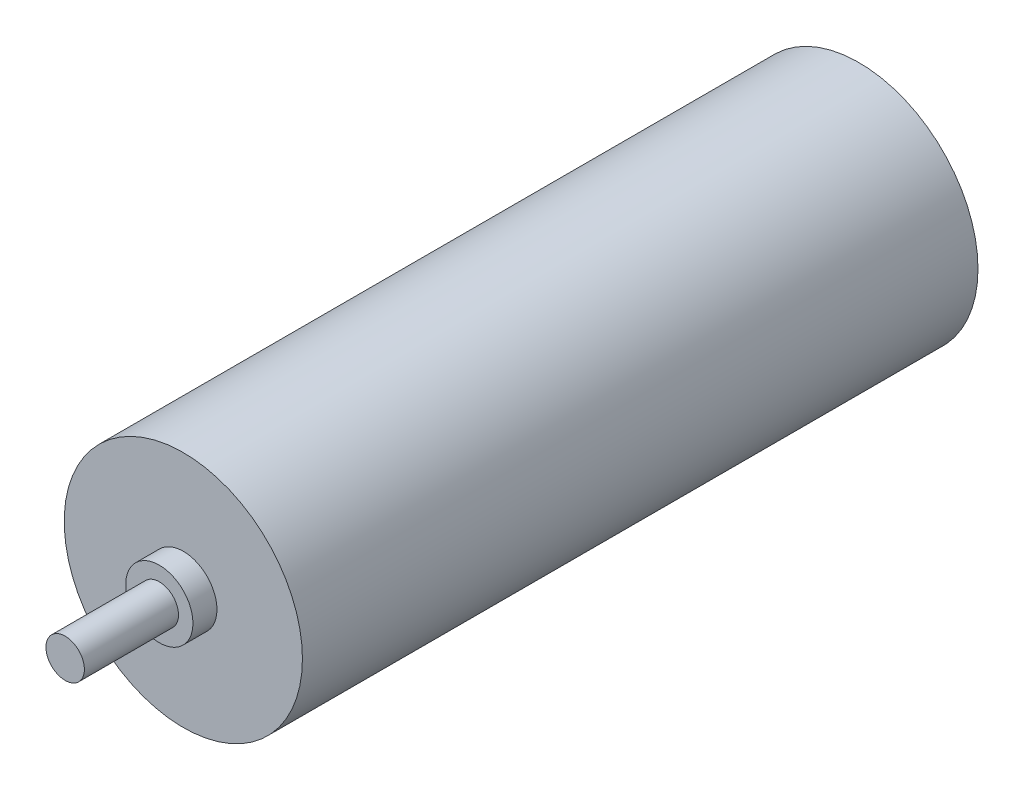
ISO-10303-21;
HEADER;
FILE_DESCRIPTION(('STEP AP214'),'2;1');
FILE_NAME('part.step','',(''),(''),'','','');
FILE_SCHEMA(('AUTOMOTIVE_DESIGN { 1 0 10303 214 1 1 1 1 }'));
ENDSEC;
DATA;
#1=APPLICATION_CONTEXT('core data for automotive mechanical design processes');
#2=APPLICATION_PROTOCOL_DEFINITION('international standard','automotive_design',2000,#1);
#3=PRODUCT_CONTEXT('',#1,'mechanical');
#4=PRODUCT('Part','Part','',(#3));
#5=PRODUCT_RELATED_PRODUCT_CATEGORY('part','',(#4));
#6=PRODUCT_DEFINITION_FORMATION('','',#4);
#7=PRODUCT_DEFINITION_CONTEXT('part definition',#1,'design');
#8=PRODUCT_DEFINITION('design','',#6,#7);
#9=PRODUCT_DEFINITION_SHAPE('','',#8);
#10=(LENGTH_UNIT() NAMED_UNIT(*) SI_UNIT(.MILLI.,.METRE.));
#11=(NAMED_UNIT(*) PLANE_ANGLE_UNIT() SI_UNIT($,.RADIAN.));
#12=(NAMED_UNIT(*) SI_UNIT($,.STERADIAN.) SOLID_ANGLE_UNIT());
#13=UNCERTAINTY_MEASURE_WITH_UNIT(LENGTH_MEASURE(1.E-05),#10,'distance_accuracy_value','');
#14=(GEOMETRIC_REPRESENTATION_CONTEXT(3) GLOBAL_UNCERTAINTY_ASSIGNED_CONTEXT((#13)) GLOBAL_UNIT_ASSIGNED_CONTEXT((#10,
#11,#12)) REPRESENTATION_CONTEXT('',''));
#15=CARTESIAN_POINT('',(0.,0.,0.));
#16=DIRECTION('',(0.,0.,1.));
#17=DIRECTION('',(1.,0.,0.));
#18=AXIS2_PLACEMENT_3D('',#15,#16,#17);
#19=CARTESIAN_POINT('',(0.,0.,72.83));
#20=DIRECTION('',(0.,0.,1.));
#21=DIRECTION('',(1.,0.,0.));
#22=AXIS2_PLACEMENT_3D('',#19,#20,#21);
#23=PLANE('',#22);
#24=CARTESIAN_POINT('',(0.,0.,72.83));
#25=DIRECTION('',(0.,0.,1.));
#26=DIRECTION('',(1.,0.,0.));
#27=AXIS2_PLACEMENT_3D('',#24,#25,#26);
#28=CIRCLE('',#27,3.5);
#29=CARTESIAN_POINT('',(3.5,0.,72.83));
#30=VERTEX_POINT('',#29);
#31=EDGE_CURVE('E39',#30,#30,#28,.T.);
#32=ORIENTED_EDGE('',*,*,#31,.T.);
#33=EDGE_LOOP('',(#32));
#34=FACE_BOUND('',#33,.T.);
#35=CARTESIAN_POINT('',(0.,0.,72.83));
#36=DIRECTION('',(0.,0.,1.));
#37=DIRECTION('',(1.,0.,0.));
#38=AXIS2_PLACEMENT_3D('',#35,#36,#37);
#39=CIRCLE('',#38,2.);
#40=CARTESIAN_POINT('',(2.,0.,72.83));
#41=VERTEX_POINT('',#40);
#42=EDGE_CURVE('E47',#41,#41,#39,.T.);
#43=ORIENTED_EDGE('',*,*,#42,.F.);
#44=EDGE_LOOP('',(#43));
#45=FACE_BOUND('',#44,.T.);
#46=ADVANCED_FACE('F28',(#34,#45),#23,.T.);
#47=CARTESIAN_POINT('',(0.,0.,70.33));
#48=DIRECTION('',(0.,0.,1.));
#49=DIRECTION('',(1.,0.,0.));
#50=AXIS2_PLACEMENT_3D('',#47,#48,#49);
#51=PLANE('',#50);
#52=CARTESIAN_POINT('',(0.,0.,70.33));
#53=DIRECTION('',(0.,0.,1.));
#54=DIRECTION('',(1.,0.,0.));
#55=AXIS2_PLACEMENT_3D('',#52,#53,#54);
#56=CIRCLE('',#55,12.4);
#57=CARTESIAN_POINT('',(12.4,0.,70.33));
#58=VERTEX_POINT('',#57);
#59=EDGE_CURVE('E10',#58,#58,#56,.T.);
#60=ORIENTED_EDGE('',*,*,#59,.T.);
#61=EDGE_LOOP('',(#60));
#62=FACE_BOUND('',#61,.T.);
#63=CARTESIAN_POINT('',(0.,0.,70.33));
#64=DIRECTION('',(0.,0.,1.));
#65=DIRECTION('',(1.,0.,0.));
#66=AXIS2_PLACEMENT_3D('',#63,#64,#65);
#67=CIRCLE('',#66,3.5);
#68=CARTESIAN_POINT('',(3.5,0.,70.33));
#69=VERTEX_POINT('',#68);
#70=EDGE_CURVE('E41',#69,#69,#67,.T.);
#71=ORIENTED_EDGE('',*,*,#70,.F.);
#72=EDGE_LOOP('',(#71));
#73=FACE_BOUND('',#72,.T.);
#74=ADVANCED_FACE('F63',(#62,#73),#51,.T.);
#75=CARTESIAN_POINT('',(0.,0.,70.33));
#76=DIRECTION('',(0.,0.,-1.));
#77=DIRECTION('',(-1.,0.,0.));
#78=AXIS2_PLACEMENT_3D('',#75,#76,#77);
#79=CYLINDRICAL_SURFACE('',#78,12.4);
#80=ORIENTED_EDGE('',*,*,#59,.F.);
#81=EDGE_LOOP('',(#80));
#82=FACE_BOUND('',#81,.T.);
#83=CARTESIAN_POINT('',(0.,0.,0.));
#84=DIRECTION('',(0.,0.,1.));
#85=DIRECTION('',(1.,0.,0.));
#86=AXIS2_PLACEMENT_3D('',#83,#84,#85);
#87=CIRCLE('',#86,12.4);
#88=CARTESIAN_POINT('',(12.4,0.,0.));
#89=VERTEX_POINT('',#88);
#90=EDGE_CURVE('E32',#89,#89,#87,.T.);
#91=ORIENTED_EDGE('',*,*,#90,.T.);
#92=EDGE_LOOP('',(#91));
#93=FACE_BOUND('',#92,.T.);
#94=ADVANCED_FACE('F30',(#82,#93),#79,.T.);
#95=CARTESIAN_POINT('',(0.,0.,0.));
#96=DIRECTION('',(0.,0.,1.));
#97=DIRECTION('',(1.,0.,0.));
#98=AXIS2_PLACEMENT_3D('',#95,#96,#97);
#99=PLANE('',#98);
#100=ORIENTED_EDGE('',*,*,#90,.F.);
#101=EDGE_LOOP('',(#100));
#102=FACE_BOUND('',#101,.T.);
#103=ADVANCED_FACE('F73',(#102),#99,.F.);
#104=CARTESIAN_POINT('',(0.,0.,72.83));
#105=DIRECTION('',(0.,0.,-1.));
#106=DIRECTION('',(-1.,0.,0.));
#107=AXIS2_PLACEMENT_3D('',#104,#105,#106);
#108=CYLINDRICAL_SURFACE('',#107,3.5);
#109=ORIENTED_EDGE('',*,*,#31,.F.);
#110=EDGE_LOOP('',(#109));
#111=FACE_BOUND('',#110,.T.);
#112=ORIENTED_EDGE('',*,*,#70,.T.);
#113=EDGE_LOOP('',(#112));
#114=FACE_BOUND('',#113,.T.);
#115=ADVANCED_FACE('F58',(#111,#114),#108,.T.);
#116=CARTESIAN_POINT('',(0.,0.,82.63));
#117=DIRECTION('',(0.,0.,-1.));
#118=DIRECTION('',(-1.,0.,0.));
#119=AXIS2_PLACEMENT_3D('',#116,#117,#118);
#120=CYLINDRICAL_SURFACE('',#119,2.);
#121=CARTESIAN_POINT('',(0.,0.,82.63));
#122=DIRECTION('',(0.,0.,1.));
#123=DIRECTION('',(1.,0.,0.));
#124=AXIS2_PLACEMENT_3D('',#121,#122,#123);
#125=CIRCLE('',#124,2.);
#126=CARTESIAN_POINT('',(2.,0.,82.63));
#127=VERTEX_POINT('',#126);
#128=EDGE_CURVE('E44',#127,#127,#125,.T.);
#129=ORIENTED_EDGE('',*,*,#128,.F.);
#130=EDGE_LOOP('',(#129));
#131=FACE_BOUND('',#130,.T.);
#132=ORIENTED_EDGE('',*,*,#42,.T.);
#133=EDGE_LOOP('',(#132));
#134=FACE_BOUND('',#133,.T.);
#135=ADVANCED_FACE('F55',(#131,#134),#120,.T.);
#136=CARTESIAN_POINT('',(0.,0.,82.63));
#137=DIRECTION('',(0.,0.,1.));
#138=DIRECTION('',(1.,0.,0.));
#139=AXIS2_PLACEMENT_3D('',#136,#137,#138);
#140=PLANE('',#139);
#141=ORIENTED_EDGE('',*,*,#128,.T.);
#142=EDGE_LOOP('',(#141));
#143=FACE_BOUND('',#142,.T.);
#144=ADVANCED_FACE('F53',(#143),#140,.T.);
#145=CLOSED_SHELL('',(#46,#74,#94,#103,#115,#135,#144));
#146=MANIFOLD_SOLID_BREP('B2',#145);
#147=ADVANCED_BREP_SHAPE_REPRESENTATION('',(#18,#146),#14);
#148=SHAPE_DEFINITION_REPRESENTATION(#9,#147);
ENDSEC;
END-ISO-10303-21;
